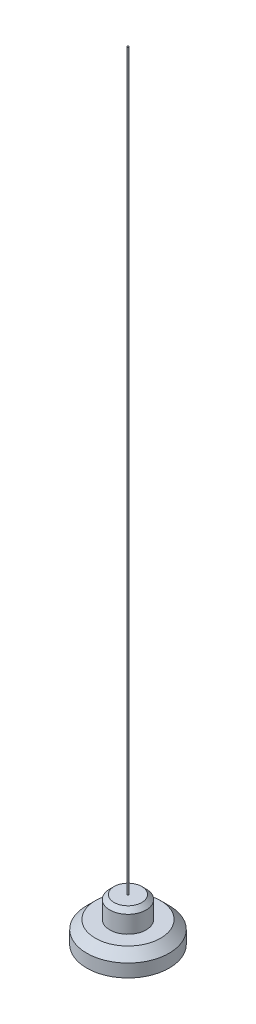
ISO-10303-21;
HEADER;
FILE_DESCRIPTION(('STEP AP214'),'2;1');
FILE_NAME('part.step','',(''),(''),'','','');
FILE_SCHEMA(('AUTOMOTIVE_DESIGN { 1 0 10303 214 1 1 1 1 }'));
ENDSEC;
DATA;
#1=APPLICATION_CONTEXT('core data for automotive mechanical design processes');
#2=APPLICATION_PROTOCOL_DEFINITION('international standard','automotive_design',2000,#1);
#3=PRODUCT_CONTEXT('',#1,'mechanical');
#4=PRODUCT('Part','Part','',(#3));
#5=PRODUCT_RELATED_PRODUCT_CATEGORY('part','',(#4));
#6=PRODUCT_DEFINITION_FORMATION('','',#4);
#7=PRODUCT_DEFINITION_CONTEXT('part definition',#1,'design');
#8=PRODUCT_DEFINITION('design','',#6,#7);
#9=PRODUCT_DEFINITION_SHAPE('','',#8);
#10=(LENGTH_UNIT() NAMED_UNIT(*) SI_UNIT(.MILLI.,.METRE.));
#11=(NAMED_UNIT(*) PLANE_ANGLE_UNIT() SI_UNIT($,.RADIAN.));
#12=(NAMED_UNIT(*) SI_UNIT($,.STERADIAN.) SOLID_ANGLE_UNIT());
#13=UNCERTAINTY_MEASURE_WITH_UNIT(LENGTH_MEASURE(1.E-05),#10,'distance_accuracy_value','');
#14=(GEOMETRIC_REPRESENTATION_CONTEXT(3) GLOBAL_UNCERTAINTY_ASSIGNED_CONTEXT((#13)) GLOBAL_UNIT_ASSIGNED_CONTEXT((#10,
#11,#12)) REPRESENTATION_CONTEXT('',''));
#15=CARTESIAN_POINT('',(0.,0.,0.));
#16=DIRECTION('',(0.,0.,1.));
#17=DIRECTION('',(1.,0.,0.));
#18=AXIS2_PLACEMENT_3D('',#15,#16,#17);
#19=CARTESIAN_POINT('',(0.,25.4,0.));
#20=DIRECTION('',(0.,1.,0.));
#21=DIRECTION('',(0.,0.,1.));
#22=AXIS2_PLACEMENT_3D('',#19,#20,#21);
#23=PLANE('',#22);
#24=CARTESIAN_POINT('',(0.,25.4,0.));
#25=DIRECTION('',(0.,1.,0.));
#26=DIRECTION('',(0.,0.,1.));
#27=AXIS2_PLACEMENT_3D('',#24,#25,#26);
#28=CIRCLE('',#27,8.15192281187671);
#29=CARTESIAN_POINT('',(0.,25.4,8.15192281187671));
#30=VERTEX_POINT('',#29);
#31=EDGE_CURVE('E47',#30,#30,#28,.T.);
#32=ORIENTED_EDGE('',*,*,#31,.T.);
#33=EDGE_LOOP('',(#32));
#34=FACE_BOUND('',#33,.T.);
#35=CARTESIAN_POINT('',(0.,25.4,0.));
#36=DIRECTION('',(0.,1.,0.));
#37=DIRECTION('',(0.,0.,1.));
#38=AXIS2_PLACEMENT_3D('',#35,#36,#37);
#39=CIRCLE('',#38,0.508);
#40=CARTESIAN_POINT('',(0.,25.4,0.508));
#41=VERTEX_POINT('',#40);
#42=EDGE_CURVE('E60',#41,#41,#39,.T.);
#43=ORIENTED_EDGE('',*,*,#42,.F.);
#44=EDGE_LOOP('',(#43));
#45=FACE_BOUND('',#44,.T.);
#46=ADVANCED_FACE('F40',(#34,#45),#23,.T.);
#47=CARTESIAN_POINT('',(0.,25.4,0.));
#48=DIRECTION('',(0.,-1.,0.));
#49=DIRECTION('',(0.,0.,-1.));
#50=AXIS2_PLACEMENT_3D('',#47,#48,#49);
#51=CYLINDRICAL_SURFACE('',#50,10.6919228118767);
#52=CARTESIAN_POINT('',(0.,22.86,0.));
#53=DIRECTION('',(0.,1.,0.));
#54=DIRECTION('',(0.,0.,1.));
#55=AXIS2_PLACEMENT_3D('',#52,#53,#54);
#56=CIRCLE('',#55,10.6919228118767);
#57=CARTESIAN_POINT('',(0.,22.86,10.6919228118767));
#58=VERTEX_POINT('',#57);
#59=EDGE_CURVE('E11',#58,#58,#56,.F.);
#60=ORIENTED_EDGE('',*,*,#59,.T.);
#61=EDGE_LOOP('',(#60));
#62=FACE_BOUND('',#61,.T.);
#63=CARTESIAN_POINT('',(0.,12.7,0.));
#64=DIRECTION('',(0.,1.,0.));
#65=DIRECTION('',(0.,0.,1.));
#66=AXIS2_PLACEMENT_3D('',#63,#64,#65);
#67=CIRCLE('',#66,10.6919228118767);
#68=CARTESIAN_POINT('',(0.,12.7,10.6919228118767));
#69=VERTEX_POINT('',#68);
#70=EDGE_CURVE('E51',#69,#69,#67,.T.);
#71=ORIENTED_EDGE('',*,*,#70,.T.);
#72=EDGE_LOOP('',(#71));
#73=FACE_BOUND('',#72,.T.);
#74=ADVANCED_FACE('F42',(#62,#73),#51,.T.);
#75=CARTESIAN_POINT('',(0.,12.7,0.));
#76=DIRECTION('',(0.,1.,0.));
#77=DIRECTION('',(0.,0.,1.));
#78=AXIS2_PLACEMENT_3D('',#75,#76,#77);
#79=PLANE('',#78);
#80=ORIENTED_EDGE('',*,*,#70,.F.);
#81=EDGE_LOOP('',(#80));
#82=FACE_BOUND('',#81,.T.);
#83=ADVANCED_FACE('F70',(#82),#79,.F.);
#84=CARTESIAN_POINT('',(0.,25.4,0.));
#85=DIRECTION('',(0.,-1.,0.));
#86=DIRECTION('',(0.,0.,-1.));
#87=AXIS2_PLACEMENT_3D('',#84,#85,#86);
#88=CONICAL_SURFACE('',#87,8.15192281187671,0.785398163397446);
#89=ORIENTED_EDGE('',*,*,#59,.F.);
#90=EDGE_LOOP('',(#89));
#91=FACE_BOUND('',#90,.T.);
#92=ORIENTED_EDGE('',*,*,#31,.F.);
#93=EDGE_LOOP('',(#92));
#94=FACE_BOUND('',#93,.T.);
#95=ADVANCED_FACE('F74',(#91,#94),#88,.T.);
#96=CARTESIAN_POINT('',(0.,457.2,0.));
#97=DIRECTION('',(0.,-1.,0.));
#98=DIRECTION('',(0.,0.,-1.));
#99=AXIS2_PLACEMENT_3D('',#96,#97,#98);
#100=CYLINDRICAL_SURFACE('',#99,0.508);
#101=CARTESIAN_POINT('',(0.,457.2,0.));
#102=DIRECTION('',(0.,1.,0.));
#103=DIRECTION('',(0.,0.,1.));
#104=AXIS2_PLACEMENT_3D('',#101,#102,#103);
#105=CIRCLE('',#104,0.508);
#106=CARTESIAN_POINT('',(0.,457.2,0.508));
#107=VERTEX_POINT('',#106);
#108=EDGE_CURVE('E55',#107,#107,#105,.T.);
#109=ORIENTED_EDGE('',*,*,#108,.F.);
#110=EDGE_LOOP('',(#109));
#111=FACE_BOUND('',#110,.T.);
#112=ORIENTED_EDGE('',*,*,#42,.T.);
#113=EDGE_LOOP('',(#112));
#114=FACE_BOUND('',#113,.T.);
#115=ADVANCED_FACE('F64',(#111,#114),#100,.T.);
#116=CARTESIAN_POINT('',(0.,457.2,0.));
#117=DIRECTION('',(0.,1.,0.));
#118=DIRECTION('',(0.,0.,1.));
#119=AXIS2_PLACEMENT_3D('',#116,#117,#118);
#120=PLANE('',#119);
#121=ORIENTED_EDGE('',*,*,#108,.T.);
#122=EDGE_LOOP('',(#121));
#123=FACE_BOUND('',#122,.T.);
#124=ADVANCED_FACE('F81',(#123),#120,.T.);
#125=CLOSED_SHELL('',(#46,#74,#83,#95,#115,#124));
#126=MANIFOLD_SOLID_BREP('B2',#125);
#127=CARTESIAN_POINT('',(0.,12.7,0.));
#128=DIRECTION('',(0.,-1.,0.));
#129=DIRECTION('',(0.,0.,-1.));
#130=AXIS2_PLACEMENT_3D('',#127,#128,#129);
#131=CYLINDRICAL_SURFACE('',#130,24.257);
#132=CARTESIAN_POINT('',(0.,7.61999999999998,0.));
#133=DIRECTION('',(0.,1.,0.));
#134=DIRECTION('',(0.,0.,1.));
#135=AXIS2_PLACEMENT_3D('',#132,#133,#134);
#136=CIRCLE('',#135,24.257);
#137=CARTESIAN_POINT('',(0.,7.61999999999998,24.257));
#138=VERTEX_POINT('',#137);
#139=EDGE_CURVE('E39',#138,#138,#136,.F.);
#140=ORIENTED_EDGE('',*,*,#139,.T.);
#141=EDGE_LOOP('',(#140));
#142=FACE_BOUND('',#141,.T.);
#143=CARTESIAN_POINT('',(0.,0.,0.));
#144=DIRECTION('',(0.,1.,0.));
#145=DIRECTION('',(0.,0.,1.));
#146=AXIS2_PLACEMENT_3D('',#143,#144,#145);
#147=CIRCLE('',#146,24.257);
#148=CARTESIAN_POINT('',(0.,0.,24.257));
#149=VERTEX_POINT('',#148);
#150=EDGE_CURVE('E135',#149,#149,#147,.T.);
#151=ORIENTED_EDGE('',*,*,#150,.T.);
#152=EDGE_LOOP('',(#151));
#153=FACE_BOUND('',#152,.T.);
#154=ADVANCED_FACE('F125',(#142,#153),#131,.T.);
#155=CARTESIAN_POINT('',(0.,12.7,0.));
#156=DIRECTION('',(0.,1.,0.));
#157=DIRECTION('',(0.,0.,1.));
#158=AXIS2_PLACEMENT_3D('',#155,#156,#157);
#159=PLANE('',#158);
#160=CARTESIAN_POINT('',(0.,12.7,0.));
#161=DIRECTION('',(0.,1.,0.));
#162=DIRECTION('',(0.,0.,1.));
#163=AXIS2_PLACEMENT_3D('',#160,#161,#162);
#164=CIRCLE('',#163,19.177);
#165=CARTESIAN_POINT('',(0.,12.7,19.177));
#166=VERTEX_POINT('',#165);
#167=EDGE_CURVE('E131',#166,#166,#164,.T.);
#168=ORIENTED_EDGE('',*,*,#167,.T.);
#169=EDGE_LOOP('',(#168));
#170=FACE_BOUND('',#169,.T.);
#171=ADVANCED_FACE('F146',(#170),#159,.T.);
#172=CARTESIAN_POINT('',(0.,0.,0.));
#173=DIRECTION('',(0.,1.,0.));
#174=DIRECTION('',(0.,0.,1.));
#175=AXIS2_PLACEMENT_3D('',#172,#173,#174);
#176=PLANE('',#175);
#177=ORIENTED_EDGE('',*,*,#150,.F.);
#178=EDGE_LOOP('',(#177));
#179=FACE_BOUND('',#178,.T.);
#180=ADVANCED_FACE('F143',(#179),#176,.F.);
#181=CARTESIAN_POINT('',(0.,12.7,0.));
#182=DIRECTION('',(0.,-1.,0.));
#183=DIRECTION('',(0.,0.,-1.));
#184=AXIS2_PLACEMENT_3D('',#181,#182,#183);
#185=CONICAL_SURFACE('',#184,19.177,0.785398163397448);
#186=ORIENTED_EDGE('',*,*,#139,.F.);
#187=EDGE_LOOP('',(#186));
#188=FACE_BOUND('',#187,.T.);
#189=ORIENTED_EDGE('',*,*,#167,.F.);
#190=EDGE_LOOP('',(#189));
#191=FACE_BOUND('',#190,.T.);
#192=ADVANCED_FACE('F145',(#188,#191),#185,.T.);
#193=CLOSED_SHELL('',(#154,#171,#180,#192));
#194=MANIFOLD_SOLID_BREP('B6',#193);
#195=ADVANCED_BREP_SHAPE_REPRESENTATION('',(#18,#126,#194),#14);
#196=SHAPE_DEFINITION_REPRESENTATION(#9,#195);
ENDSEC;
END-ISO-10303-21;
